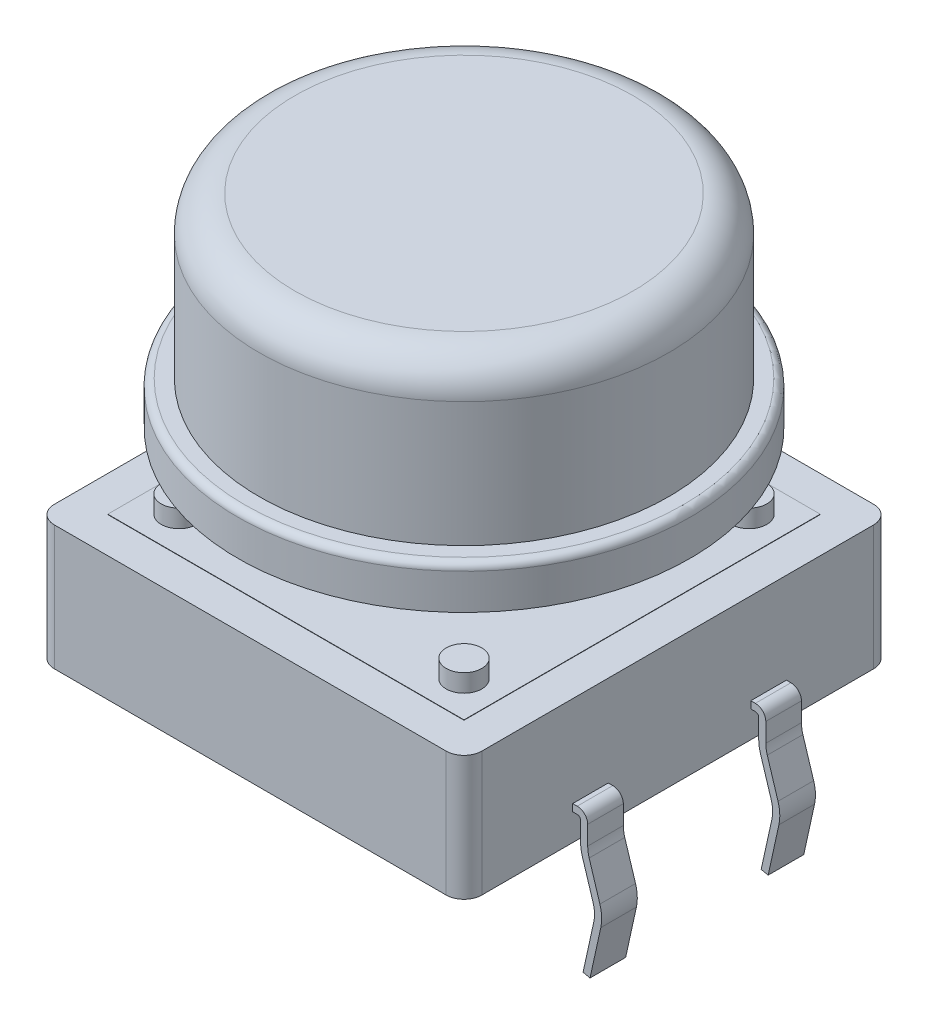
from build123d import *

# Parameters (mm, degrees)
EXTRUSION2_DEPTH = 3.5
ESQUISSE2_W      = 10
ESQUISSE2_H      = 10
EXTRUSION5_DEPTH = 0.01
ESQUISSE6_R      = 0.5
EXTRUSION6_DEPTH = 0.5
ESQUISSE7_R      = 3.05
EXTRUSION7_DEPTH = 0.8
ESQUISSE10_W     = 1
ESQUISSE10_H     = 0.2


with BuildPart() as part:
    # Esquisse1 → Extrusion2 (new body)
    with BuildSketch(Plane(origin=(0, 0, 0), x_dir=(1, 0, 0), z_dir=(0, 1, 0))):
        with BuildLine():
            Line((-5.5, -6), (5.5, -6))
            ThreePointArc((5.5, -6), (5.853553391, -5.853553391), (6, -5.5))
            Line((6, -5.5), (6, 5.5))
            ThreePointArc((6, 5.5), (5.853553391, 5.853553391), (5.5, 6))
            Line((5.5, 6), (-5.5, 6))
            ThreePointArc((-5.5, 6), (-5.853553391, 5.853553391), (-6, 5.5))
            Line((-6, 5.5), (-6, -5.5))
            ThreePointArc((-6, -5.5), (-5.853553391, -5.853553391), (-5.5, -6))
        make_face()
    extrude(amount=EXTRUSION2_DEPTH)

    # Esquisse2 → Extrusion5 (add)
    with BuildSketch(Plane(origin=(0, 3.5, 0), x_dir=(-1, 0, 0), z_dir=(0, 1, 0))):
        Rectangle(ESQUISSE2_W, ESQUISSE2_H)
    extrude(amount=EXTRUSION5_DEPTH)

    # Esquisse6 → Extrusion6 (add)
    with BuildSketch(Plane(origin=(0, 3.51, 0), x_dir=(-1, 0, 0), z_dir=(0, 1, 0))):
        with Locations(Location((4, 4, 0), (0, 0, 270))):
            Circle(ESQUISSE6_R)
        with Locations(Location((-4, 4, 0), (0, 0, 270))):
            Circle(ESQUISSE6_R)
        with Locations(Location((-4, -4, 0), (0, 0, 270))):
            Circle(ESQUISSE6_R)
        with Locations(Location((4, -4, 0), (0, 0, 270))):
            Circle(ESQUISSE6_R)
    extrude(amount=EXTRUSION6_DEPTH)

    # Esquisse7 → Extrusion7 (add)
    with BuildSketch(Plane(origin=(0, 3.51, 0), x_dir=(-1, 0, 0), z_dir=(0, 1, 0))):
        with Locations(Location((0, 0, 0), (0, 0, 270))):
            Circle(ESQUISSE7_R)
    extrude(amount=EXTRUSION7_DEPTH)

    # Esquisse11 → R_volution2 (revolve)
    with BuildSketch(Plane(origin=(0, 0, 0), x_dir=(0, 0, -1), z_dir=(1, 0, 0)), mode=Mode.PRIVATE) as r_volution2_sk:
        with BuildLine():
            Line((0, 11.31), (-4.75, 11.31))
            ThreePointArc((-4.75, 11.31), (-5.457106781, 11.017106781), (-5.75, 10.31))
            Line((-5.75, 10.31), (-5.75, 6.81))
            Line((-5.75, 6.81), (-6.15, 6.81))
            ThreePointArc((-6.15, 6.81), (-6.291421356, 6.751421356), (-6.35, 6.61))
            Line((-6.35, 6.61), (-6.35, 5.61))
            Line((-6.35, 5.61), (-2.7, 5.61))
            Line((-2.7, 5.61), (-2.7, 4.31))
            Line((-2.7, 4.31), (0, 4.31))
            Line((0, 4.31), (0, 11.31))
        make_face()
    revolve(r_volution2_sk.sketch.rotate(Axis((0, 4.31, 0), (0, 1, 0)), 180), axis=Axis((0, 4.31, 0), (0, 1, 0)))


with BuildPart() as body_2:
    # Balayage2: sweep along a curve in space
    with BuildLine() as balayage2_path:
        Line((-6.050870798, 0.906156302, 2.505204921), (-6.178164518, 0.906156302, 2.505204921))
        ThreePointArc((-6.178164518, 0.906156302, 2.505204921), (-6.319550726, 0.847612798, 2.505204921), (-6.378164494, 0.706255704, 2.505204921))
        Line((-6.378164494, 0.706255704, 2.505204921), (-6.378427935, 0.176202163, 2.505204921))
        ThreePointArc((-6.378427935, 0.176202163, 2.505204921), (-6.389851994, 0.025974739, 2.505204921), (-6.423715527, -0.120831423, 2.505204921))
        Line((-6.423715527, -0.120831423, 2.505204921), (-6.725750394, -1.089996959, 2.505204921))
        ThreePointArc((-6.725750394, -1.089996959, 2.505204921), (-6.770113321, -1.344530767, 2.505204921), (-6.747782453, -1.601934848, 2.505204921))
        Line((-6.747782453, -1.601934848, 2.505204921), (-6.445811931, -2.977578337, 2.505204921))
    # Esquisse10 → Balayage2 (sweep)
    with BuildSketch(Plane.ZY.offset(6.05)):
        with Locations((2.5, 0.9)):
            Rectangle(ESQUISSE10_W, ESQUISSE10_H)
    sweep(path=balayage2_path.line)


with BuildPart() as body_3:
    # Sym_trie2: mirrored copy
    add(body_2.part.mirror(Plane(origin=(0, 0, 0), x_dir=(1, 0, 0), z_dir=(0, 0, -1))))


with BuildPart() as body_4:
    # Sym_trie3: mirrored copy
    add(body_3.part.mirror(Plane.ZY))


with BuildPart() as body_5:
    # Sym_trie3 2: mirrored copy
    add(body_2.part.mirror(Plane.ZY))


solid = Compound([part.part, body_2.part, body_3.part, body_4.part, body_5.part])
